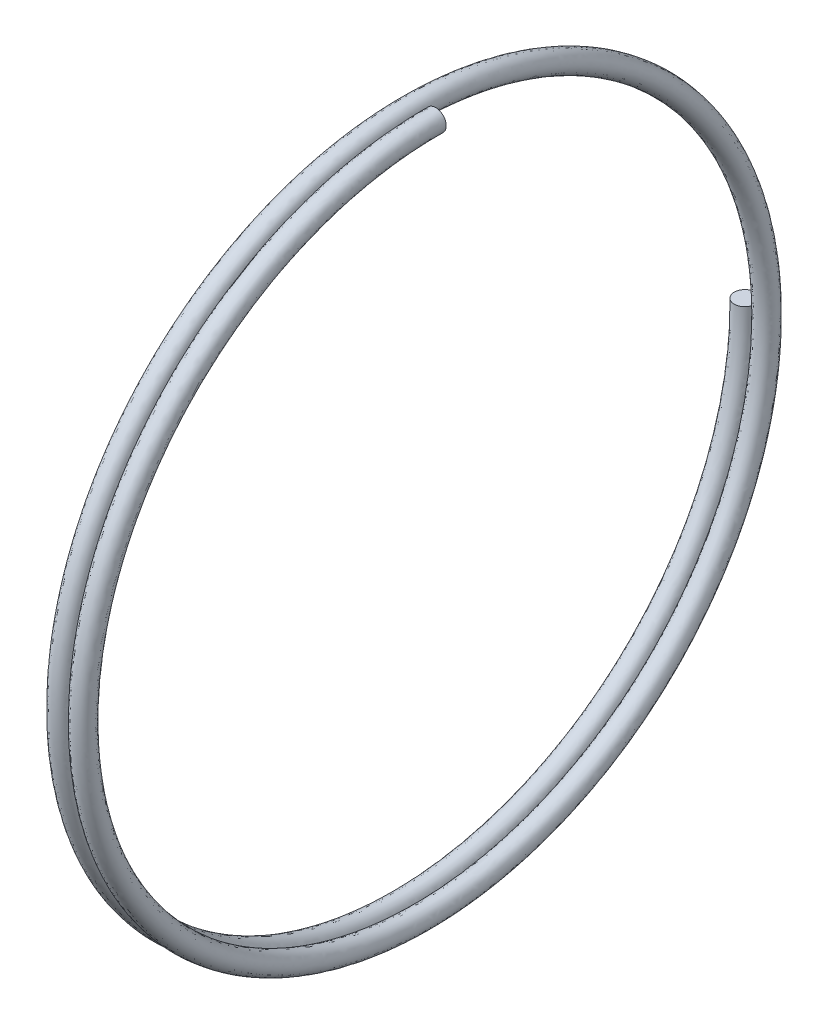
ISO-10303-21;
HEADER;
FILE_DESCRIPTION(('STEP AP214'),'2;1');
FILE_NAME('part.step','',(''),(''),'','','');
FILE_SCHEMA(('AUTOMOTIVE_DESIGN { 1 0 10303 214 1 1 1 1 }'));
ENDSEC;
DATA;
#1=APPLICATION_CONTEXT('core data for automotive mechanical design processes');
#2=APPLICATION_PROTOCOL_DEFINITION('international standard','automotive_design',2000,#1);
#3=PRODUCT_CONTEXT('',#1,'mechanical');
#4=PRODUCT('Part','Part','',(#3));
#5=PRODUCT_RELATED_PRODUCT_CATEGORY('part','',(#4));
#6=PRODUCT_DEFINITION_FORMATION('','',#4);
#7=PRODUCT_DEFINITION_CONTEXT('part definition',#1,'design');
#8=PRODUCT_DEFINITION('design','',#6,#7);
#9=PRODUCT_DEFINITION_SHAPE('','',#8);
#10=(LENGTH_UNIT() NAMED_UNIT(*) SI_UNIT(.MILLI.,.METRE.));
#11=(NAMED_UNIT(*) PLANE_ANGLE_UNIT() SI_UNIT($,.RADIAN.));
#12=(NAMED_UNIT(*) SI_UNIT($,.STERADIAN.) SOLID_ANGLE_UNIT());
#13=UNCERTAINTY_MEASURE_WITH_UNIT(LENGTH_MEASURE(1.E-05),#10,'distance_accuracy_value','');
#14=(GEOMETRIC_REPRESENTATION_CONTEXT(3) GLOBAL_UNCERTAINTY_ASSIGNED_CONTEXT((#13)) GLOBAL_UNIT_ASSIGNED_CONTEXT((#10,
#11,#12)) REPRESENTATION_CONTEXT('',''));
#15=CARTESIAN_POINT('',(0.,0.,0.));
#16=DIRECTION('',(0.,0.,1.));
#17=DIRECTION('',(1.,0.,0.));
#18=AXIS2_PLACEMENT_3D('',#15,#16,#17);
#19=CARTESIAN_POINT('',(0.,0.,-49.5000000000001));
#20=DIRECTION('',(0.,1.,0.));
#21=DIRECTION('',(0.,0.,1.));
#22=AXIS2_PLACEMENT_3D('',#19,#20,#21);
#23=PLANE('',#22);
#24=CARTESIAN_POINT('',(0.,0.,-49.5000000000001));
#25=DIRECTION('',(0.,1.,0.));
#26=DIRECTION('',(0.,0.,1.));
#27=AXIS2_PLACEMENT_3D('',#24,#25,#26);
#28=CIRCLE('',#27,1.5);
#29=CARTESIAN_POINT('',(0.,0.,-48.0000000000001));
#30=VERTEX_POINT('',#29);
#31=EDGE_CURVE('E45',#30,#30,#28,.T.);
#32=ORIENTED_EDGE('',*,*,#31,.T.);
#33=EDGE_LOOP('',(#32));
#34=FACE_BOUND('',#33,.T.);
#35=ADVANCED_FACE('F35',(#34),#23,.T.);
#36=CARTESIAN_POINT('',(5.42500000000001,49.5000000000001,-1.2097989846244E-12));
#37=DIRECTION('',(0.,0.,1.));
#38=DIRECTION('',(0.,-1.,0.));
#39=AXIS2_PLACEMENT_3D('',#36,#37,#38);
#40=PLANE('',#39);
#41=CARTESIAN_POINT('',(5.42500000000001,49.5000000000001,-1.2097989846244E-12));
#42=DIRECTION('',(0.,0.,1.));
#43=DIRECTION('',(0.,-1.,0.));
#44=AXIS2_PLACEMENT_3D('',#41,#42,#43);
#45=CIRCLE('',#44,1.5);
#46=CARTESIAN_POINT('',(5.42500000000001,48.0000000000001,-1.17313840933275E-12));
#47=VERTEX_POINT('',#46);
#48=EDGE_CURVE('E11',#47,#47,#45,.T.);
#49=ORIENTED_EDGE('',*,*,#48,.F.);
#50=EDGE_LOOP('',(#49));
#51=FACE_BOUND('',#50,.T.);
#52=ADVANCED_FACE('F53',(#51),#40,.F.);
#53=CARTESIAN_POINT('',(0.,0.,-48.0000000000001));
#54=CARTESIAN_POINT('',(0.258333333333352,-27.7128129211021,-48.));
#55=CARTESIAN_POINT('',(0.516666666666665,-41.5692193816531,-24.));
#56=CARTESIAN_POINT('',(0.774999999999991,-55.4256258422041,0.));
#57=CARTESIAN_POINT('',(1.03333333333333,-41.5692193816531,24.));
#58=CARTESIAN_POINT('',(1.29166666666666,-27.7128129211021,48.));
#59=CARTESIAN_POINT('',(1.55,0.,48.0000000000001));
#60=CARTESIAN_POINT('',(1.80833333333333,27.7128129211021,48.));
#61=CARTESIAN_POINT('',(2.06666666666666,41.5692193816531,24.0000000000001));
#62=CARTESIAN_POINT('',(2.325,55.4256258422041,0.));
#63=CARTESIAN_POINT('',(2.58333333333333,41.5692193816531,-24.));
#64=CARTESIAN_POINT('',(2.84166666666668,27.7128129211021,-48.));
#65=CARTESIAN_POINT('',(3.09999999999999,0.,-48.0000000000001));
#66=CARTESIAN_POINT('',(3.35833333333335,-27.7128129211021,-48.));
#67=CARTESIAN_POINT('',(3.61666666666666,-41.5692193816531,-24.));
#68=CARTESIAN_POINT('',(3.87499999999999,-55.4256258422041,0.));
#69=CARTESIAN_POINT('',(4.13333333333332,-41.5692193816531,24.));
#70=CARTESIAN_POINT('',(4.39166666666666,-27.7128129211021,48.));
#71=CARTESIAN_POINT('',(4.64999999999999,0.,48.0000000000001));
#72=CARTESIAN_POINT('',(4.90833333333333,27.7128129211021,48.));
#73=CARTESIAN_POINT('',(5.16666666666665,41.5692193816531,24.0000000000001));
#74=CARTESIAN_POINT('',(5.425,55.4256258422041,0.));
#75=CARTESIAN_POINT('',(5.68333333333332,41.5692193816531,-24.));
#76=CARTESIAN_POINT('',(5.94166666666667,27.7128129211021,-48.));
#77=CARTESIAN_POINT('',(6.19999999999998,0.,-48.0000000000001));
#78=CARTESIAN_POINT('',(3.,0.,-48.));
#79=CARTESIAN_POINT('',(3.25833333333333,-27.7128129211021,-48.0000000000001));
#80=CARTESIAN_POINT('',(3.51666666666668,-41.5692193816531,-24.));
#81=CARTESIAN_POINT('',(3.775,-55.4256258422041,0.));
#82=CARTESIAN_POINT('',(4.03333333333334,-41.5692193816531,24.));
#83=CARTESIAN_POINT('',(4.29166666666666,-27.7128129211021,48.));
#84=CARTESIAN_POINT('',(4.55,0.,48.));
#85=CARTESIAN_POINT('',(4.80833333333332,27.712812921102,48.0000000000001));
#86=CARTESIAN_POINT('',(5.06666666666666,41.5692193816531,24.));
#87=CARTESIAN_POINT('',(5.32499999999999,55.4256258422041,0.));
#88=CARTESIAN_POINT('',(5.58333333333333,41.5692193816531,-24.));
#89=CARTESIAN_POINT('',(5.84166666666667,27.7128129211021,-48.));
#90=CARTESIAN_POINT('',(6.09999999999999,0.,-48.));
#91=CARTESIAN_POINT('',(6.35833333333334,-27.7128129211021,-48.0000000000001));
#92=CARTESIAN_POINT('',(6.61666666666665,-41.5692193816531,-24.));
#93=CARTESIAN_POINT('',(6.875,-55.4256258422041,0.));
#94=CARTESIAN_POINT('',(7.13333333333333,-41.5692193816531,24.));
#95=CARTESIAN_POINT('',(7.39166666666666,-27.7128129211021,48.));
#96=CARTESIAN_POINT('',(7.64999999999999,0.,48.));
#97=CARTESIAN_POINT('',(7.90833333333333,27.712812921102,48.0000000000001));
#98=CARTESIAN_POINT('',(8.16666666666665,41.5692193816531,24.));
#99=CARTESIAN_POINT('',(8.42499999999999,55.4256258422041,0.));
#100=CARTESIAN_POINT('',(8.68333333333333,41.5692193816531,-24.));
#101=CARTESIAN_POINT('',(8.94166666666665,27.7128129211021,-48.));
#102=CARTESIAN_POINT('',(9.19999999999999,0.,-48.));
#103=CARTESIAN_POINT('',(3.,0.,-51.));
#104=CARTESIAN_POINT('',(3.25833333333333,-29.4448637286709,-51.0000000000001));
#105=CARTESIAN_POINT('',(3.51666666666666,-44.1672955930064,-25.5));
#106=CARTESIAN_POINT('',(3.775,-58.8897274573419,0.));
#107=CARTESIAN_POINT('',(4.03333333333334,-44.1672955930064,25.5));
#108=CARTESIAN_POINT('',(4.29166666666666,-29.444863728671,51.));
#109=CARTESIAN_POINT('',(4.55,0.,51.));
#110=CARTESIAN_POINT('',(4.80833333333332,29.4448637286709,51.0000000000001));
#111=CARTESIAN_POINT('',(5.06666666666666,44.1672955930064,25.5));
#112=CARTESIAN_POINT('',(5.32499999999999,58.8897274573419,0.));
#113=CARTESIAN_POINT('',(5.58333333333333,44.1672955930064,-25.5));
#114=CARTESIAN_POINT('',(5.84166666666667,29.444863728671,-51.));
#115=CARTESIAN_POINT('',(6.09999999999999,0.,-51.));
#116=CARTESIAN_POINT('',(6.35833333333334,-29.4448637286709,-51.0000000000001));
#117=CARTESIAN_POINT('',(6.61666666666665,-44.1672955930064,-25.5));
#118=CARTESIAN_POINT('',(6.875,-58.8897274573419,0.));
#119=CARTESIAN_POINT('',(7.13333333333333,-44.1672955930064,25.5));
#120=CARTESIAN_POINT('',(7.39166666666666,-29.444863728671,51.));
#121=CARTESIAN_POINT('',(7.64999999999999,0.,51.));
#122=CARTESIAN_POINT('',(7.90833333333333,29.4448637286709,51.0000000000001));
#123=CARTESIAN_POINT('',(8.16666666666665,44.1672955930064,25.5));
#124=CARTESIAN_POINT('',(8.42499999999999,58.8897274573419,0.));
#125=CARTESIAN_POINT('',(8.68333333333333,44.1672955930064,-25.5));
#126=CARTESIAN_POINT('',(8.94166666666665,29.444863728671,-51.));
#127=CARTESIAN_POINT('',(9.19999999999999,0.,-51.));
#128=CARTESIAN_POINT('',(0.,0.,-51.0000000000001));
#129=CARTESIAN_POINT('',(0.258333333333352,-29.4448637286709,-51.));
#130=CARTESIAN_POINT('',(0.516666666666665,-44.1672955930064,-25.5));
#131=CARTESIAN_POINT('',(0.774999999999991,-58.8897274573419,0.));
#132=CARTESIAN_POINT('',(1.03333333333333,-44.1672955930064,25.5));
#133=CARTESIAN_POINT('',(1.29166666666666,-29.444863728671,51.));
#134=CARTESIAN_POINT('',(1.55,0.,51.0000000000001));
#135=CARTESIAN_POINT('',(1.80833333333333,29.4448637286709,51.));
#136=CARTESIAN_POINT('',(2.06666666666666,44.1672955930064,25.5000000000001));
#137=CARTESIAN_POINT('',(2.325,58.8897274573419,0.));
#138=CARTESIAN_POINT('',(2.58333333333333,44.1672955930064,-25.5));
#139=CARTESIAN_POINT('',(2.84166666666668,29.444863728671,-51.));
#140=CARTESIAN_POINT('',(3.09999999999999,0.,-51.0000000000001));
#141=CARTESIAN_POINT('',(3.35833333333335,-29.4448637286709,-51.));
#142=CARTESIAN_POINT('',(3.61666666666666,-44.1672955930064,-25.5));
#143=CARTESIAN_POINT('',(3.87499999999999,-58.8897274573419,0.));
#144=CARTESIAN_POINT('',(4.13333333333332,-44.1672955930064,25.5));
#145=CARTESIAN_POINT('',(4.39166666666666,-29.444863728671,51.));
#146=CARTESIAN_POINT('',(4.64999999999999,0.,51.0000000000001));
#147=CARTESIAN_POINT('',(4.90833333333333,29.4448637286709,51.));
#148=CARTESIAN_POINT('',(5.16666666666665,44.1672955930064,25.5000000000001));
#149=CARTESIAN_POINT('',(5.425,58.8897274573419,0.));
#150=CARTESIAN_POINT('',(5.68333333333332,44.1672955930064,-25.5));
#151=CARTESIAN_POINT('',(5.94166666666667,29.444863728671,-51.));
#152=CARTESIAN_POINT('',(6.19999999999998,0.,-51.0000000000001));
#153=CARTESIAN_POINT('',(-3.,0.,-51.));
#154=CARTESIAN_POINT('',(-2.74166666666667,-29.4448637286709,-51.0000000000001));
#155=CARTESIAN_POINT('',(-2.48333333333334,-44.1672955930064,-25.5));
#156=CARTESIAN_POINT('',(-2.22500000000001,-58.8897274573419,0.));
#157=CARTESIAN_POINT('',(-1.96666666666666,-44.1672955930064,25.5));
#158=CARTESIAN_POINT('',(-1.70833333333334,-29.444863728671,51.));
#159=CARTESIAN_POINT('',(-1.45000000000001,0.,51.));
#160=CARTESIAN_POINT('',(-1.19166666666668,29.4448637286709,51.0000000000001));
#161=CARTESIAN_POINT('',(-0.933333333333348,44.1672955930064,25.5));
#162=CARTESIAN_POINT('',(-0.675000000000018,58.8897274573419,0.));
#163=CARTESIAN_POINT('',(-0.416666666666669,44.1672955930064,-25.5));
#164=CARTESIAN_POINT('',(-0.15833333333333,29.444863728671,-51.));
#165=CARTESIAN_POINT('',(0.099999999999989,0.,-51.));
#166=CARTESIAN_POINT('',(0.358333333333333,-29.4448637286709,-51.0000000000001));
#167=CARTESIAN_POINT('',(0.616666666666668,-44.1672955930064,-25.5));
#168=CARTESIAN_POINT('',(0.874999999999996,-58.8897274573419,0.));
#169=CARTESIAN_POINT('',(1.13333333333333,-44.1672955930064,25.5));
#170=CARTESIAN_POINT('',(1.39166666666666,-29.444863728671,51.));
#171=CARTESIAN_POINT('',(1.64999999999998,0.,51.));
#172=CARTESIAN_POINT('',(1.90833333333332,29.4448637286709,51.0000000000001));
#173=CARTESIAN_POINT('',(2.16666666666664,44.1672955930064,25.5));
#174=CARTESIAN_POINT('',(2.42499999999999,58.8897274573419,0.));
#175=CARTESIAN_POINT('',(2.68333333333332,44.1672955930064,-25.5));
#176=CARTESIAN_POINT('',(2.94166666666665,29.444863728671,-51.));
#177=CARTESIAN_POINT('',(3.19999999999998,0.,-51.));
#178=CARTESIAN_POINT('',(-3.,0.,-48.));
#179=CARTESIAN_POINT('',(-2.74166666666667,-27.7128129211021,-48.0000000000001));
#180=CARTESIAN_POINT('',(-2.48333333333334,-41.5692193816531,-24.));
#181=CARTESIAN_POINT('',(-2.22500000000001,-55.4256258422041,0.));
#182=CARTESIAN_POINT('',(-1.96666666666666,-41.5692193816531,24.));
#183=CARTESIAN_POINT('',(-1.70833333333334,-27.7128129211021,48.));
#184=CARTESIAN_POINT('',(-1.45000000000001,0.,48.));
#185=CARTESIAN_POINT('',(-1.19166666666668,27.712812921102,48.0000000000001));
#186=CARTESIAN_POINT('',(-0.933333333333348,41.5692193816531,24.));
#187=CARTESIAN_POINT('',(-0.675000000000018,55.4256258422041,0.));
#188=CARTESIAN_POINT('',(-0.416666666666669,41.5692193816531,-24.));
#189=CARTESIAN_POINT('',(-0.15833333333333,27.7128129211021,-48.));
#190=CARTESIAN_POINT('',(0.099999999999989,0.,-48.));
#191=CARTESIAN_POINT('',(0.358333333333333,-27.7128129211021,-48.0000000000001));
#192=CARTESIAN_POINT('',(0.616666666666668,-41.5692193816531,-24.));
#193=CARTESIAN_POINT('',(0.874999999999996,-55.4256258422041,0.));
#194=CARTESIAN_POINT('',(1.13333333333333,-41.5692193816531,24.));
#195=CARTESIAN_POINT('',(1.39166666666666,-27.7128129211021,48.));
#196=CARTESIAN_POINT('',(1.64999999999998,0.,48.));
#197=CARTESIAN_POINT('',(1.90833333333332,27.712812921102,48.0000000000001));
#198=CARTESIAN_POINT('',(2.16666666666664,41.5692193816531,24.));
#199=CARTESIAN_POINT('',(2.42499999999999,55.4256258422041,0.));
#200=CARTESIAN_POINT('',(2.68333333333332,41.5692193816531,-24.));
#201=CARTESIAN_POINT('',(2.94166666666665,27.7128129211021,-48.));
#202=CARTESIAN_POINT('',(3.19999999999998,0.,-48.));
#203=CARTESIAN_POINT('',(0.,0.,-48.0000000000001));
#204=CARTESIAN_POINT('',(0.258333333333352,-27.7128129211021,-48.));
#205=CARTESIAN_POINT('',(0.516666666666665,-41.5692193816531,-24.));
#206=CARTESIAN_POINT('',(0.774999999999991,-55.4256258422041,0.));
#207=CARTESIAN_POINT('',(1.03333333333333,-41.5692193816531,24.));
#208=CARTESIAN_POINT('',(1.29166666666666,-27.7128129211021,48.));
#209=CARTESIAN_POINT('',(1.55,0.,48.0000000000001));
#210=CARTESIAN_POINT('',(1.80833333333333,27.7128129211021,48.));
#211=CARTESIAN_POINT('',(2.06666666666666,41.5692193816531,24.0000000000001));
#212=CARTESIAN_POINT('',(2.325,55.4256258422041,0.));
#213=CARTESIAN_POINT('',(2.58333333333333,41.5692193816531,-24.));
#214=CARTESIAN_POINT('',(2.84166666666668,27.7128129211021,-48.));
#215=CARTESIAN_POINT('',(3.09999999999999,0.,-48.0000000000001));
#216=CARTESIAN_POINT('',(3.35833333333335,-27.7128129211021,-48.));
#217=CARTESIAN_POINT('',(3.61666666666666,-41.5692193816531,-24.));
#218=CARTESIAN_POINT('',(3.87499999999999,-55.4256258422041,0.));
#219=CARTESIAN_POINT('',(4.13333333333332,-41.5692193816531,24.));
#220=CARTESIAN_POINT('',(4.39166666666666,-27.7128129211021,48.));
#221=CARTESIAN_POINT('',(4.64999999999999,0.,48.0000000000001));
#222=CARTESIAN_POINT('',(4.90833333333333,27.7128129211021,48.));
#223=CARTESIAN_POINT('',(5.16666666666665,41.5692193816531,24.0000000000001));
#224=CARTESIAN_POINT('',(5.425,55.4256258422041,0.));
#225=CARTESIAN_POINT('',(5.68333333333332,41.5692193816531,-24.));
#226=CARTESIAN_POINT('',(5.94166666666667,27.7128129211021,-48.));
#227=CARTESIAN_POINT('',(6.19999999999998,0.,-48.0000000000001));
#228=(BOUNDED_SURFACE() B_SPLINE_SURFACE(3,2,((#53,#54,#55,#56,#57,#58,#59,#60,#61,#62,#63,#64,
#65,#66,#67,#68,#69,#70,#71,#72,#73,#74,#75,#76,#77),(#78,#79,#80,#81,#82,#83,#84,#85,#86,#87,
#88,#89,#90,#91,#92,#93,#94,#95,#96,#97,#98,#99,#100,#101,#102),(#103,#104,#105,#106,#107,#108,
#109,#110,#111,#112,#113,#114,#115,#116,#117,#118,#119,#120,#121,#122,#123,#124,#125,#126,#127),
(#128,#129,#130,#131,#132,#133,#134,#135,#136,#137,#138,#139,#140,#141,#142,#143,#144,#145,#146,
#147,#148,#149,#150,#151,#152),(#153,#154,#155,#156,#157,#158,#159,#160,#161,#162,#163,#164,
#165,#166,#167,#168,#169,#170,#171,#172,#173,#174,#175,#176,#177),(#178,#179,#180,#181,#182,
#183,#184,#185,#186,#187,#188,#189,#190,#191,#192,#193,#194,#195,#196,#197,#198,#199,#200,#201,
#202),(#203,#204,#205,#206,#207,#208,#209,#210,#211,#212,#213,#214,#215,#216,#217,#218,#219,
#220,#221,#222,#223,#224,#225,#226,#227)),.UNSPECIFIED.,.T.,.F.,
.F.) B_SPLINE_SURFACE_WITH_KNOTS((4,3,4),(3,2,2,2,2,2,2,2,2,2,2,2,3),(0.,0.5,1.),(0.,
0.0833333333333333,0.166666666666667,0.25,0.333333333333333,0.416666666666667,0.5,
0.583333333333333,0.666666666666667,0.75,0.833333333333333,0.916666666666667,1.),
.UNSPECIFIED.) GEOMETRIC_REPRESENTATION_ITEM() RATIONAL_B_SPLINE_SURFACE(((1.,0.866025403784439,
1.,0.866025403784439,1.,0.866025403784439,1.,0.866025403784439,1.,0.866025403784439,1.,
0.866025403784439,1.,0.866025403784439,1.,0.866025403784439,1.,0.866025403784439,1.,
0.866025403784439,1.,0.866025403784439,1.,0.866025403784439,1.),(0.333333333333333,
0.288675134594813,0.333333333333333,0.288675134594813,0.333333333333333,0.288675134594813,
0.333333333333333,0.288675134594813,0.333333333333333,0.288675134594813,0.333333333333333,
0.288675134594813,0.333333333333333,0.288675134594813,0.333333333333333,0.288675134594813,
0.333333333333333,0.288675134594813,0.333333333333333,0.288675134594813,0.333333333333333,
0.288675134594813,0.333333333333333,0.288675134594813,0.333333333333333),(0.333333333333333,
0.288675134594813,0.333333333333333,0.288675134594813,0.333333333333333,0.288675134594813,
0.333333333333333,0.288675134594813,0.333333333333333,0.288675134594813,0.333333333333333,
0.288675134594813,0.333333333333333,0.288675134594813,0.333333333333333,0.288675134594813,
0.333333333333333,0.288675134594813,0.333333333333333,0.288675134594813,0.333333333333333,
0.288675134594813,0.333333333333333,0.288675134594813,0.333333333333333),(1.,0.866025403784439,
1.,0.866025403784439,1.,0.866025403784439,1.,0.866025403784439,1.,0.866025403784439,1.,
0.866025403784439,1.,0.866025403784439,1.,0.866025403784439,1.,0.866025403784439,1.,
0.866025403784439,1.,0.866025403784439,1.,0.866025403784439,1.),(0.333333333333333,
0.288675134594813,0.333333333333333,0.288675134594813,0.333333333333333,0.288675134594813,
0.333333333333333,0.288675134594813,0.333333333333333,0.288675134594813,0.333333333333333,
0.288675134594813,0.333333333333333,0.288675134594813,0.333333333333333,0.288675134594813,
0.333333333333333,0.288675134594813,0.333333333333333,0.288675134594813,0.333333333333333,
0.288675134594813,0.333333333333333,0.288675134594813,0.333333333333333),(0.333333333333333,
0.288675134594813,0.333333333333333,0.288675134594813,0.333333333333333,0.288675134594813,
0.333333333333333,0.288675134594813,0.333333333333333,0.288675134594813,0.333333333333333,
0.288675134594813,0.333333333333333,0.288675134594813,0.333333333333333,0.288675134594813,
0.333333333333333,0.288675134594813,0.333333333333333,0.288675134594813,0.333333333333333,
0.288675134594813,0.333333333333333,0.288675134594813,0.333333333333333),(1.,0.866025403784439,
1.,0.866025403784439,1.,0.866025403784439,1.,0.866025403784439,1.,0.866025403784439,1.,
0.866025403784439,1.,0.866025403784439,1.,0.866025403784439,1.,0.866025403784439,1.,
0.866025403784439,1.,0.866025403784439,1.,0.866025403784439,1.))) REPRESENTATION_ITEM('') SURFACE());
#229=ORIENTED_EDGE('',*,*,#48,.T.);
#230=EDGE_LOOP('',(#229));
#231=FACE_BOUND('',#230,.T.);
#232=ORIENTED_EDGE('',*,*,#31,.F.);
#233=EDGE_LOOP('',(#232));
#234=FACE_BOUND('',#233,.T.);
#235=ADVANCED_FACE('F37',(#231,#234),#228,.F.);
#236=CLOSED_SHELL('',(#35,#52,#235));
#237=MANIFOLD_SOLID_BREP('B2',#236);
#238=ADVANCED_BREP_SHAPE_REPRESENTATION('',(#18,#237),#14);
#239=SHAPE_DEFINITION_REPRESENTATION(#9,#238);
ENDSEC;
END-ISO-10303-21;
